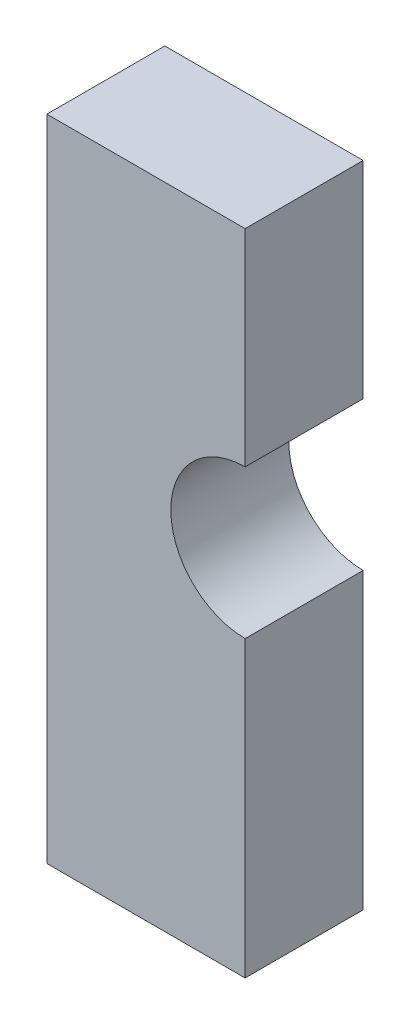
from build123d import *

# Parameters (mm, degrees)
BOSS_EXTRUDE1_DEPTH = 12.7


with BuildPart() as part:
    # Sketch1 → Boss-Extrude1 (new body)
    with BuildSketch(Plane.XY):
        with BuildLine():
            Line((21.339638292, 31.638980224), (21.339638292, 0))
            Line((21.339638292, 0), (0, 0))
            Line((0, 0), (0, 69.85))
            Line((0, 69.85), (21.339638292, 69.85))
            Line((21.339638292, 69.85), (21.339638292, 47.638980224))
            ThreePointArc((21.339638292, 47.638980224), (13.339638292, 39.638980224), (21.339638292, 31.638980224))
        make_face()
    extrude(amount=-BOSS_EXTRUDE1_DEPTH)


solid = part.part
